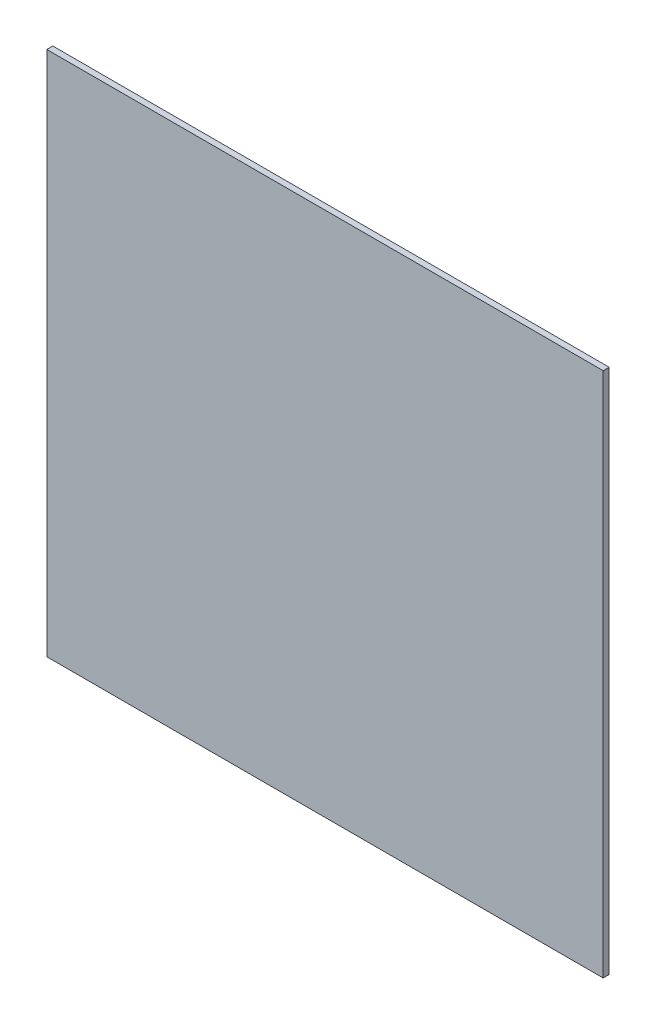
from build123d import *

# Parameters (mm, degrees)
ESQUISSE1_W      = 1481
ESQUISSE1_H      = 1400
EXTRUSION1_DEPTH = 8


with BuildPart() as part:
    # Esquisse1 → Extrusion1 (new, symmetric)
    with BuildSketch(Plane.XY):
        with Locations((-775, 1265)):
            Rectangle(ESQUISSE1_W, ESQUISSE1_H)
    extrude(amount=EXTRUSION1_DEPTH, both=True)


solid = part.part
